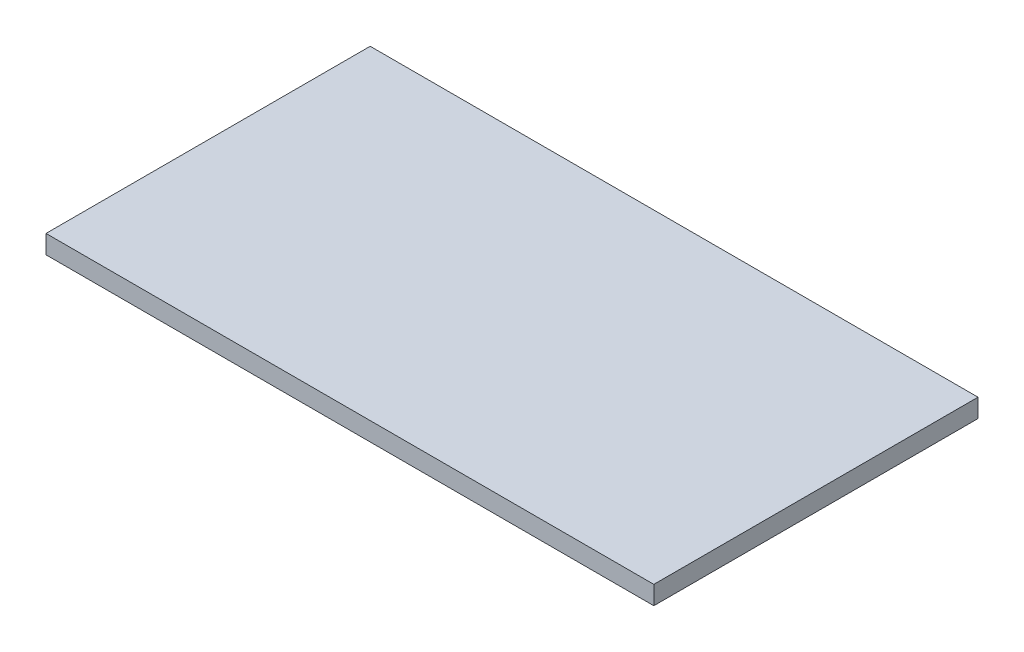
ISO-10303-21;
HEADER;
FILE_DESCRIPTION(('STEP AP214'),'2;1');
FILE_NAME('part.step','',(''),(''),'','','');
FILE_SCHEMA(('AUTOMOTIVE_DESIGN { 1 0 10303 214 1 1 1 1 }'));
ENDSEC;
DATA;
#1=APPLICATION_CONTEXT('core data for automotive mechanical design processes');
#2=APPLICATION_PROTOCOL_DEFINITION('international standard','automotive_design',2000,#1);
#3=PRODUCT_CONTEXT('',#1,'mechanical');
#4=PRODUCT('Part','Part','',(#3));
#5=PRODUCT_RELATED_PRODUCT_CATEGORY('part','',(#4));
#6=PRODUCT_DEFINITION_FORMATION('','',#4);
#7=PRODUCT_DEFINITION_CONTEXT('part definition',#1,'design');
#8=PRODUCT_DEFINITION('design','',#6,#7);
#9=PRODUCT_DEFINITION_SHAPE('','',#8);
#10=(LENGTH_UNIT() NAMED_UNIT(*) SI_UNIT(.MILLI.,.METRE.));
#11=(NAMED_UNIT(*) PLANE_ANGLE_UNIT() SI_UNIT($,.RADIAN.));
#12=(NAMED_UNIT(*) SI_UNIT($,.STERADIAN.) SOLID_ANGLE_UNIT());
#13=UNCERTAINTY_MEASURE_WITH_UNIT(LENGTH_MEASURE(1.E-05),#10,'distance_accuracy_value','');
#14=(GEOMETRIC_REPRESENTATION_CONTEXT(3) GLOBAL_UNCERTAINTY_ASSIGNED_CONTEXT((#13)) GLOBAL_UNIT_ASSIGNED_CONTEXT((#10,
#11,#12)) REPRESENTATION_CONTEXT('',''));
#15=CARTESIAN_POINT('',(0.,0.,0.));
#16=DIRECTION('',(0.,0.,1.));
#17=DIRECTION('',(1.,0.,0.));
#18=AXIS2_PLACEMENT_3D('',#15,#16,#17);
#19=CARTESIAN_POINT('',(300.,331.167332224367,345.));
#20=DIRECTION('',(0.,1.,0.));
#21=DIRECTION('',(-1.,0.,0.));
#22=AXIS2_PLACEMENT_3D('',#19,#20,#21);
#23=PLANE('',#22);
#24=DIRECTION('',(1.,0.,0.));
#25=VECTOR('',#24,1.);
#26=CARTESIAN_POINT('',(300.,331.167332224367,25.));
#27=LINE('',#26,#25);
#28=CARTESIAN_POINT('',(-300.,331.167332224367,25.));
#29=VERTEX_POINT('',#28);
#30=CARTESIAN_POINT('',(300.,331.167332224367,25.));
#31=VERTEX_POINT('',#30);
#32=EDGE_CURVE('E99',#29,#31,#27,.T.);
#33=ORIENTED_EDGE('',*,*,#32,.T.);
#34=DIRECTION('',(0.,0.,-1.));
#35=VECTOR('',#34,1.);
#36=CARTESIAN_POINT('',(300.,331.167332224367,345.));
#37=LINE('',#36,#35);
#38=CARTESIAN_POINT('',(300.,331.167332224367,345.));
#39=VERTEX_POINT('',#38);
#40=EDGE_CURVE('E11',#39,#31,#37,.T.);
#41=ORIENTED_EDGE('',*,*,#40,.F.);
#42=DIRECTION('',(1.,0.,0.));
#43=VECTOR('',#42,1.);
#44=CARTESIAN_POINT('',(300.,331.167332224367,345.));
#45=LINE('',#44,#43);
#46=CARTESIAN_POINT('',(-300.,331.167332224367,345.));
#47=VERTEX_POINT('',#46);
#48=EDGE_CURVE('E87',#47,#39,#45,.T.);
#49=ORIENTED_EDGE('',*,*,#48,.F.);
#50=DIRECTION('',(0.,0.,-1.));
#51=VECTOR('',#50,1.);
#52=CARTESIAN_POINT('',(-300.,331.167332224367,345.));
#53=LINE('',#52,#51);
#54=EDGE_CURVE('E95',#47,#29,#53,.T.);
#55=ORIENTED_EDGE('',*,*,#54,.T.);
#56=EDGE_LOOP('',(#33,#41,#49,#55));
#57=FACE_BOUND('',#56,.T.);
#58=ADVANCED_FACE('F36',(#57),#23,.F.);
#59=CARTESIAN_POINT('',(300.,349.463623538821,345.));
#60=DIRECTION('',(-1.,0.,0.));
#61=DIRECTION('',(0.,0.,1.));
#62=AXIS2_PLACEMENT_3D('',#59,#60,#61);
#63=PLANE('',#62);
#64=DIRECTION('',(0.,1.,0.));
#65=VECTOR('',#64,1.);
#66=CARTESIAN_POINT('',(300.,349.463623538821,25.));
#67=LINE('',#66,#65);
#68=CARTESIAN_POINT('',(300.,349.463623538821,25.));
#69=VERTEX_POINT('',#68);
#70=EDGE_CURVE('E91',#31,#69,#67,.T.);
#71=ORIENTED_EDGE('',*,*,#70,.T.);
#72=DIRECTION('',(0.,0.,-1.));
#73=VECTOR('',#72,1.);
#74=CARTESIAN_POINT('',(300.,349.463623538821,345.));
#75=LINE('',#74,#73);
#76=CARTESIAN_POINT('',(300.,349.463623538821,345.));
#77=VERTEX_POINT('',#76);
#78=EDGE_CURVE('E44',#77,#69,#75,.T.);
#79=ORIENTED_EDGE('',*,*,#78,.F.);
#80=DIRECTION('',(0.,1.,0.));
#81=VECTOR('',#80,1.);
#82=CARTESIAN_POINT('',(300.,349.463623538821,345.));
#83=LINE('',#82,#81);
#84=EDGE_CURVE('E82',#39,#77,#83,.T.);
#85=ORIENTED_EDGE('',*,*,#84,.F.);
#86=ORIENTED_EDGE('',*,*,#40,.T.);
#87=EDGE_LOOP('',(#71,#79,#85,#86));
#88=FACE_BOUND('',#87,.T.);
#89=ADVANCED_FACE('F90',(#88),#63,.F.);
#90=CARTESIAN_POINT('',(-300.,349.463623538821,345.));
#91=DIRECTION('',(0.,-1.,0.));
#92=DIRECTION('',(0.,0.,-1.));
#93=AXIS2_PLACEMENT_3D('',#90,#91,#92);
#94=PLANE('',#93);
#95=DIRECTION('',(-1.,0.,0.));
#96=VECTOR('',#95,1.);
#97=CARTESIAN_POINT('',(-300.,349.463623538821,25.));
#98=LINE('',#97,#96);
#99=CARTESIAN_POINT('',(-300.,349.463623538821,25.));
#100=VERTEX_POINT('',#99);
#101=EDGE_CURVE('E69',#69,#100,#98,.T.);
#102=ORIENTED_EDGE('',*,*,#101,.T.);
#103=DIRECTION('',(0.,0.,-1.));
#104=VECTOR('',#103,1.);
#105=CARTESIAN_POINT('',(-300.,349.463623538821,345.));
#106=LINE('',#105,#104);
#107=CARTESIAN_POINT('',(-300.,349.463623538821,345.));
#108=VERTEX_POINT('',#107);
#109=EDGE_CURVE('E92',#108,#100,#106,.T.);
#110=ORIENTED_EDGE('',*,*,#109,.F.);
#111=DIRECTION('',(-1.,0.,0.));
#112=VECTOR('',#111,1.);
#113=CARTESIAN_POINT('',(-300.,349.463623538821,345.));
#114=LINE('',#113,#112);
#115=EDGE_CURVE('E85',#77,#108,#114,.T.);
#116=ORIENTED_EDGE('',*,*,#115,.F.);
#117=ORIENTED_EDGE('',*,*,#78,.T.);
#118=EDGE_LOOP('',(#102,#110,#116,#117));
#119=FACE_BOUND('',#118,.T.);
#120=ADVANCED_FACE('F93',(#119),#94,.F.);
#121=CARTESIAN_POINT('',(-300.,349.463623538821,345.));
#122=DIRECTION('',(1.,0.,0.));
#123=DIRECTION('',(0.,0.,-1.));
#124=AXIS2_PLACEMENT_3D('',#121,#122,#123);
#125=PLANE('',#124);
#126=DIRECTION('',(0.,-1.,0.));
#127=VECTOR('',#126,1.);
#128=CARTESIAN_POINT('',(-300.,349.463623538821,25.));
#129=LINE('',#128,#127);
#130=EDGE_CURVE('E75',#100,#29,#129,.T.);
#131=ORIENTED_EDGE('',*,*,#130,.T.);
#132=ORIENTED_EDGE('',*,*,#54,.F.);
#133=DIRECTION('',(0.,-1.,0.));
#134=VECTOR('',#133,1.);
#135=CARTESIAN_POINT('',(-300.,349.463623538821,345.));
#136=LINE('',#135,#134);
#137=EDGE_CURVE('E52',#108,#47,#136,.T.);
#138=ORIENTED_EDGE('',*,*,#137,.F.);
#139=ORIENTED_EDGE('',*,*,#109,.T.);
#140=EDGE_LOOP('',(#131,#132,#138,#139));
#141=FACE_BOUND('',#140,.T.);
#142=ADVANCED_FACE('F106',(#141),#125,.F.);
#143=CARTESIAN_POINT('',(0.,0.,345.));
#144=DIRECTION('',(0.,0.,1.));
#145=DIRECTION('',(1.,0.,0.));
#146=AXIS2_PLACEMENT_3D('',#143,#144,#145);
#147=PLANE('',#146);
#148=ORIENTED_EDGE('',*,*,#48,.T.);
#149=ORIENTED_EDGE('',*,*,#84,.T.);
#150=ORIENTED_EDGE('',*,*,#115,.T.);
#151=ORIENTED_EDGE('',*,*,#137,.T.);
#152=EDGE_LOOP('',(#148,#149,#150,#151));
#153=FACE_BOUND('',#152,.T.);
#154=ADVANCED_FACE('F83',(#153),#147,.T.);
#155=CARTESIAN_POINT('',(0.,0.,25.));
#156=DIRECTION('',(0.,0.,1.));
#157=DIRECTION('',(1.,0.,0.));
#158=AXIS2_PLACEMENT_3D('',#155,#156,#157);
#159=PLANE('',#158);
#160=ORIENTED_EDGE('',*,*,#32,.F.);
#161=ORIENTED_EDGE('',*,*,#130,.F.);
#162=ORIENTED_EDGE('',*,*,#101,.F.);
#163=ORIENTED_EDGE('',*,*,#70,.F.);
#164=EDGE_LOOP('',(#160,#161,#162,#163));
#165=FACE_BOUND('',#164,.T.);
#166=ADVANCED_FACE('F109',(#165),#159,.F.);
#167=CLOSED_SHELL('',(#58,#89,#120,#142,#154,#166));
#168=MANIFOLD_SOLID_BREP('B2',#167);
#169=ADVANCED_BREP_SHAPE_REPRESENTATION('',(#18,#168),#14);
#170=SHAPE_DEFINITION_REPRESENTATION(#9,#169);
ENDSEC;
END-ISO-10303-21;
